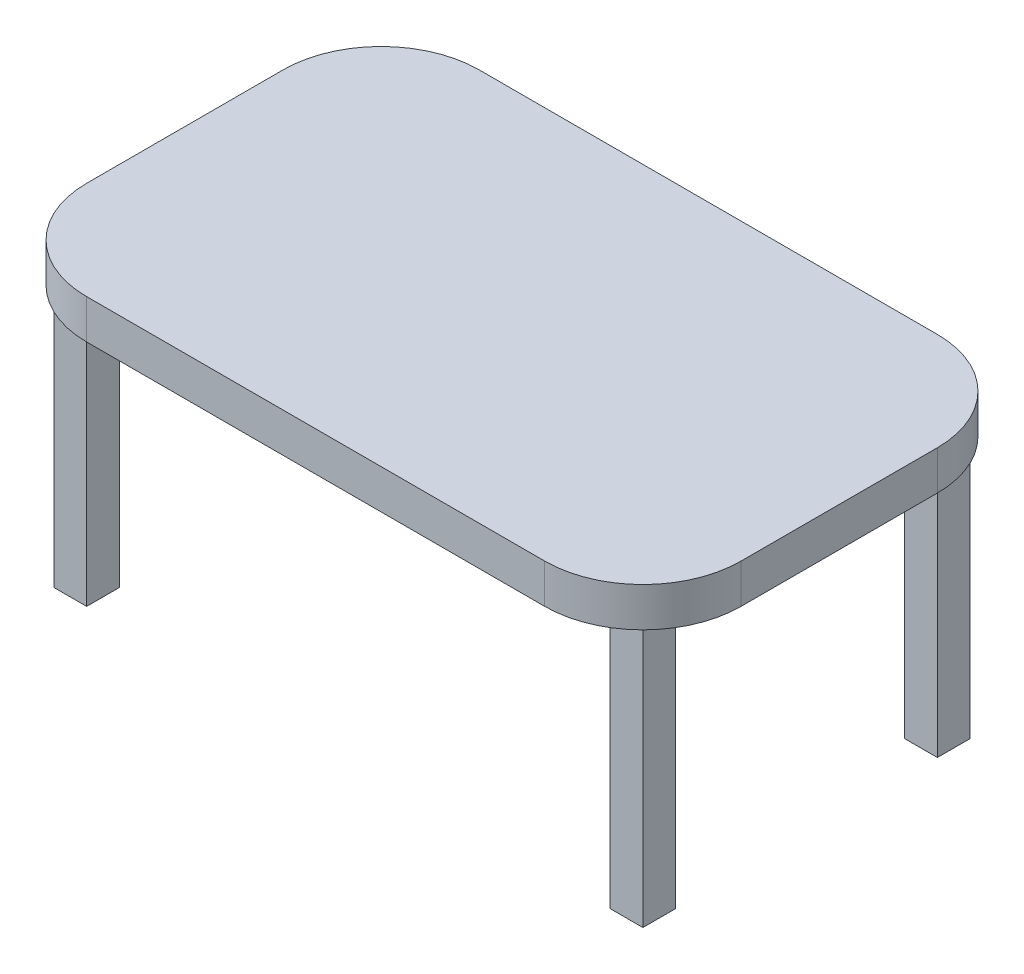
from build123d import *

# Parameters (mm, degrees)
ESQUISSE1_W               = 1000
ESQUISSE1_H               = 600
BOSS_EXTRU_1_DEPTH        = 60
ESQUISSE2_W               = 50
ESQUISSE2_H               = 50
BOSS_EXTRU_2_DEPTH        = 400
SYM_TRIE2_COPY_1_SKETCH_W = 50
SYM_TRIE2_COPY_1_SKETCH_H = 50
SYM_TRIE2_COPY_1_DEPTH    = 400
CONG_1_R                  = 150


with BuildPart() as part:
    # Esquisse1 → Boss.-Extru.1 (new body)
    with BuildSketch(Plane(origin=(0, 0, 0), x_dir=(1, 0, 0), z_dir=(0, 1, 0))):
        Rectangle(ESQUISSE1_W, ESQUISSE1_H)
    extrude(amount=BOSS_EXTRU_1_DEPTH)

    # Esquisse2 → Boss.-Extru.2 (add)
    with BuildSketch(Plane.XZ):
        with Locations((-425, 225)):
            Rectangle(ESQUISSE2_W, ESQUISSE2_H)
    boss_extru_2 = extrude(amount=BOSS_EXTRU_2_DEPTH)

    # Sym_trie1: Boss.-Extru.2 across plane
    add(boss_extru_2.mirror(Plane(origin=(0, 0, 0), x_dir=(0, 0, 1), z_dir=(1, 0, 0))))

    # Sym_trie2: Boss.-Extru.2 across plane
    add(boss_extru_2.mirror(Plane.XY))

    # Sym_trie2 copy 1 sketch → Sym_trie2 copy 1 (add)
    with BuildSketch(Plane(origin=(0, 0, 0), x_dir=(-1, 0, 0), z_dir=(0, -1, 0))):
        with Locations((-425, 225)):
            Rectangle(SYM_TRIE2_COPY_1_SKETCH_W, SYM_TRIE2_COPY_1_SKETCH_H)
    extrude(amount=SYM_TRIE2_COPY_1_DEPTH)

    # Cong_1
    cong_1_edges = [part.edges().sort_by_distance(p)[0] for p in [
        (-500, 30, -300),
        (500, 30, -300),
        (500, 30, 300),
        (-500, 30, 300),
    ]]
    fillet(cong_1_edges, radius=CONG_1_R)


solid = part.part
